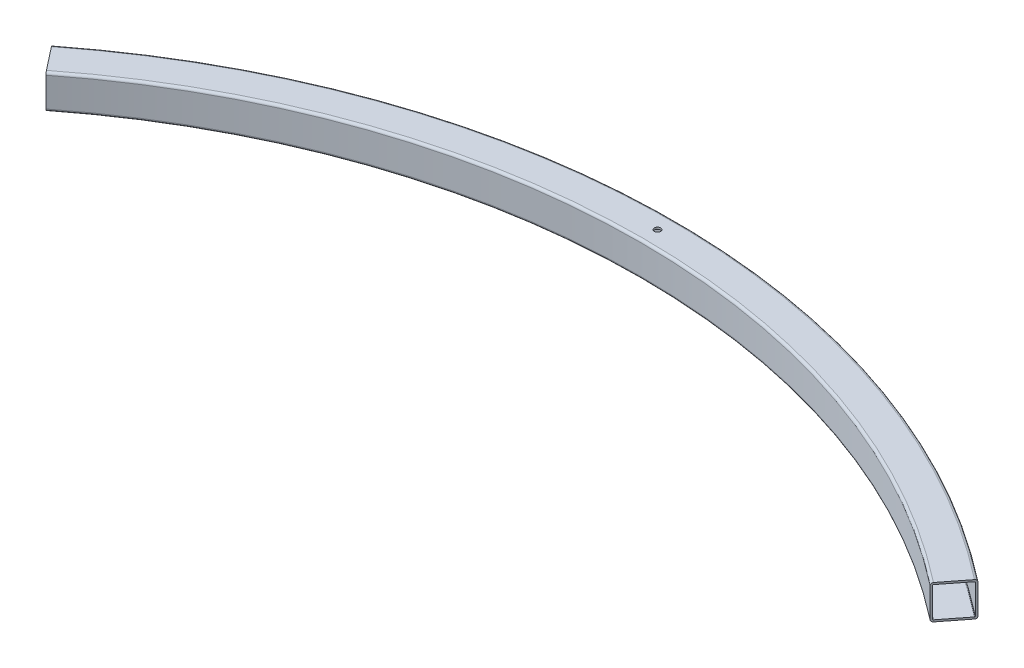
ISO-10303-21;
HEADER;
FILE_DESCRIPTION(('STEP AP214'),'2;1');
FILE_NAME('part.step','',(''),(''),'','','');
FILE_SCHEMA(('AUTOMOTIVE_DESIGN { 1 0 10303 214 1 1 1 1 }'));
ENDSEC;
DATA;
#1=APPLICATION_CONTEXT('core data for automotive mechanical design processes');
#2=APPLICATION_PROTOCOL_DEFINITION('international standard','automotive_design',2000,#1);
#3=PRODUCT_CONTEXT('',#1,'mechanical');
#4=PRODUCT('Part','Part','',(#3));
#5=PRODUCT_RELATED_PRODUCT_CATEGORY('part','',(#4));
#6=PRODUCT_DEFINITION_FORMATION('','',#4);
#7=PRODUCT_DEFINITION_CONTEXT('part definition',#1,'design');
#8=PRODUCT_DEFINITION('design','',#6,#7);
#9=PRODUCT_DEFINITION_SHAPE('','',#8);
#10=(LENGTH_UNIT() NAMED_UNIT(*) SI_UNIT(.MILLI.,.METRE.));
#11=(NAMED_UNIT(*) PLANE_ANGLE_UNIT() SI_UNIT($,.RADIAN.));
#12=(NAMED_UNIT(*) SI_UNIT($,.STERADIAN.) SOLID_ANGLE_UNIT());
#13=UNCERTAINTY_MEASURE_WITH_UNIT(LENGTH_MEASURE(1.E-05),#10,'distance_accuracy_value','');
#14=(GEOMETRIC_REPRESENTATION_CONTEXT(3) GLOBAL_UNCERTAINTY_ASSIGNED_CONTEXT((#13)) GLOBAL_UNIT_ASSIGNED_CONTEXT((#10,
#11,#12)) REPRESENTATION_CONTEXT('',''));
#15=CARTESIAN_POINT('',(0.,0.,0.));
#16=DIRECTION('',(0.,0.,1.));
#17=DIRECTION('',(1.,0.,0.));
#18=AXIS2_PLACEMENT_3D('',#15,#16,#17);
#19=CARTESIAN_POINT('',(0.,64.77,1465.075));
#20=DIRECTION('',(0.,1.,0.));
#21=DIRECTION('',(0.,0.,1.));
#22=AXIS2_PLACEMENT_3D('',#19,#20,#21);
#23=TOROIDAL_SURFACE('',#22,1470.155,1.27);
#24=CARTESIAN_POINT('',(0.,64.77,1465.075));
#25=DIRECTION('',(0.,1.,0.));
#26=DIRECTION('',(0.,0.,1.));
#27=AXIS2_PLACEMENT_3D('',#24,#25,#26);
#28=CIRCLE('',#27,1468.885);
#29=CARTESIAN_POINT('',(905.396232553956,64.77,308.407024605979));
#30=VERTEX_POINT('',#29);
#31=CARTESIAN_POINT('',(-905.396232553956,64.77,308.407024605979));
#32=VERTEX_POINT('',#31);
#33=EDGE_CURVE('E12',#30,#32,#28,.T.);
#34=ORIENTED_EDGE('',*,*,#33,.T.);
#35=CARTESIAN_POINT('',(-906.179039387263,64.77,307.406967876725));
#36=DIRECTION('',(0.787446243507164,0.,-0.616383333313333));
#37=DIRECTION('',(0.616383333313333,0.,0.787446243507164));
#38=AXIS2_PLACEMENT_3D('',#35,#36,#37);
#39=CIRCLE('',#38,1.27);
#40=CARTESIAN_POINT('',(-906.179039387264,66.04,307.406967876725));
#41=VERTEX_POINT('',#40);
#42=EDGE_CURVE('E195',#41,#32,#39,.T.);
#43=ORIENTED_EDGE('',*,*,#42,.F.);
#44=CARTESIAN_POINT('',(0.,66.04,1465.075));
#45=DIRECTION('',(0.,1.,0.));
#46=DIRECTION('',(0.,0.,1.));
#47=AXIS2_PLACEMENT_3D('',#44,#45,#46);
#48=CIRCLE('',#47,1470.155);
#49=CARTESIAN_POINT('',(906.179039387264,66.04,307.406967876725));
#50=VERTEX_POINT('',#49);
#51=EDGE_CURVE('E273',#50,#41,#48,.T.);
#52=ORIENTED_EDGE('',*,*,#51,.F.);
#53=CARTESIAN_POINT('',(906.179039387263,64.77,307.406967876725));
#54=DIRECTION('',(0.787446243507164,0.,0.616383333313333));
#55=DIRECTION('',(-0.616383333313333,0.,0.787446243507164));
#56=AXIS2_PLACEMENT_3D('',#53,#54,#55);
#57=CIRCLE('',#56,1.27);
#58=EDGE_CURVE('E240',#50,#30,#57,.T.);
#59=ORIENTED_EDGE('',*,*,#58,.T.);
#60=EDGE_LOOP('',(#34,#43,#52,#59));
#61=FACE_BOUND('',#60,.T.);
#62=ADVANCED_FACE('F34',(#61),#23,.F.);
#63=CARTESIAN_POINT('',(0.,0.,1465.075));
#64=DIRECTION('',(0.,1.,0.));
#65=DIRECTION('',(0.,0.,1.));
#66=AXIS2_PLACEMENT_3D('',#63,#64,#65);
#67=CYLINDRICAL_SURFACE('',#66,1468.885);
#68=CARTESIAN_POINT('',(0.,5.08,1465.075));
#69=DIRECTION('',(0.,1.,0.));
#70=DIRECTION('',(0.,0.,1.));
#71=AXIS2_PLACEMENT_3D('',#68,#69,#70);
#72=CIRCLE('',#71,1468.885);
#73=CARTESIAN_POINT('',(905.396232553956,5.08,308.407024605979));
#74=VERTEX_POINT('',#73);
#75=CARTESIAN_POINT('',(-905.396232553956,5.08,308.407024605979));
#76=VERTEX_POINT('',#75);
#77=EDGE_CURVE('E43',#74,#76,#72,.T.);
#78=ORIENTED_EDGE('',*,*,#77,.T.);
#79=DIRECTION('',(0.,-1.,0.));
#80=VECTOR('',#79,1.);
#81=CARTESIAN_POINT('',(-905.396232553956,5.08000000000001,308.407024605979));
#82=LINE('',#81,#80);
#83=EDGE_CURVE('E216',#32,#76,#82,.T.);
#84=ORIENTED_EDGE('',*,*,#83,.F.);
#85=ORIENTED_EDGE('',*,*,#33,.F.);
#86=DIRECTION('',(0.,-1.,0.));
#87=VECTOR('',#86,1.);
#88=CARTESIAN_POINT('',(905.396232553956,5.08000000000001,308.407024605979));
#89=LINE('',#88,#87);
#90=EDGE_CURVE('E159',#30,#74,#89,.T.);
#91=ORIENTED_EDGE('',*,*,#90,.T.);
#92=EDGE_LOOP('',(#78,#84,#85,#91));
#93=FACE_BOUND('',#92,.T.);
#94=ADVANCED_FACE('F36',(#93),#67,.T.);
#95=CARTESIAN_POINT('',(0.,5.08,1465.075));
#96=DIRECTION('',(0.,1.,0.));
#97=DIRECTION('',(0.,0.,1.));
#98=AXIS2_PLACEMENT_3D('',#95,#96,#97);
#99=TOROIDAL_SURFACE('',#98,1470.155,1.27);
#100=CARTESIAN_POINT('',(0.,3.81,1465.075));
#101=DIRECTION('',(0.,1.,0.));
#102=DIRECTION('',(0.,0.,1.));
#103=AXIS2_PLACEMENT_3D('',#100,#101,#102);
#104=CIRCLE('',#103,1470.155);
#105=CARTESIAN_POINT('',(906.179039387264,3.81,307.406967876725));
#106=VERTEX_POINT('',#105);
#107=CARTESIAN_POINT('',(-906.179039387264,3.81,307.406967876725));
#108=VERTEX_POINT('',#107);
#109=EDGE_CURVE('E283',#106,#108,#104,.T.);
#110=ORIENTED_EDGE('',*,*,#109,.T.);
#111=CARTESIAN_POINT('',(-906.179039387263,5.08,307.406967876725));
#112=DIRECTION('',(0.787446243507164,0.,-0.616383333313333));
#113=DIRECTION('',(0.616383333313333,0.,0.787446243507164));
#114=AXIS2_PLACEMENT_3D('',#111,#112,#113);
#115=CIRCLE('',#114,1.27);
#116=EDGE_CURVE('E213',#76,#108,#115,.T.);
#117=ORIENTED_EDGE('',*,*,#116,.F.);
#118=ORIENTED_EDGE('',*,*,#77,.F.);
#119=CARTESIAN_POINT('',(906.179039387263,5.08,307.406967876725));
#120=DIRECTION('',(0.787446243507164,0.,0.616383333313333));
#121=DIRECTION('',(-0.616383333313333,0.,0.787446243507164));
#122=AXIS2_PLACEMENT_3D('',#119,#120,#121);
#123=CIRCLE('',#122,1.27);
#124=EDGE_CURVE('E258',#74,#106,#123,.T.);
#125=ORIENTED_EDGE('',*,*,#124,.T.);
#126=EDGE_LOOP('',(#110,#117,#118,#125));
#127=FACE_BOUND('',#126,.T.);
#128=ADVANCED_FACE('F285',(#127),#99,.F.);
#129=CARTESIAN_POINT('',(906.179039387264,3.81,307.406967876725));
#130=DIRECTION('',(0.,1.,0.));
#131=DIRECTION('',(0.,0.,1.));
#132=AXIS2_PLACEMENT_3D('',#129,#130,#131);
#133=PLANE('',#132);
#134=CARTESIAN_POINT('',(0.,3.81,-34.9250000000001));
#135=DIRECTION('',(0.,1.,0.));
#136=DIRECTION('',(0.,0.,1.));
#137=AXIS2_PLACEMENT_3D('',#134,#135,#136);
#138=CIRCLE('',#137,6.35);
#139=CARTESIAN_POINT('',(0.,3.81,-28.5750000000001));
#140=VERTEX_POINT('',#139);
#141=EDGE_CURVE('E174',#140,#140,#138,.T.);
#142=ORIENTED_EDGE('',*,*,#141,.F.);
#143=EDGE_LOOP('',(#142));
#144=FACE_BOUND('',#143,.T.);
#145=CARTESIAN_POINT('',(0.,3.81,1465.075));
#146=DIRECTION('',(0.,1.,0.));
#147=DIRECTION('',(0.,0.,1.));
#148=AXIS2_PLACEMENT_3D('',#145,#146,#147);
#149=CIRCLE('',#148,1529.845);
#150=CARTESIAN_POINT('',(942.970960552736,3.81,260.404301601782));
#151=VERTEX_POINT('',#150);
#152=CARTESIAN_POINT('',(-942.970960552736,3.81,260.404301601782));
#153=VERTEX_POINT('',#152);
#154=EDGE_CURVE('E281',#151,#153,#149,.T.);
#155=ORIENTED_EDGE('',*,*,#154,.T.);
#156=DIRECTION('',(-0.616383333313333,0.,-0.787446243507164));
#157=VECTOR('',#156,1.);
#158=CARTESIAN_POINT('',(-906.179039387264,3.81,307.406967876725));
#159=LINE('',#158,#157);
#160=EDGE_CURVE('E210',#108,#153,#159,.T.);
#161=ORIENTED_EDGE('',*,*,#160,.F.);
#162=ORIENTED_EDGE('',*,*,#109,.F.);
#163=DIRECTION('',(0.616383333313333,0.,-0.787446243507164));
#164=VECTOR('',#163,1.);
#165=CARTESIAN_POINT('',(906.179039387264,3.81,307.406967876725));
#166=LINE('',#165,#164);
#167=EDGE_CURVE('E255',#106,#151,#166,.T.);
#168=ORIENTED_EDGE('',*,*,#167,.T.);
#169=EDGE_LOOP('',(#155,#161,#162,#168));
#170=FACE_BOUND('',#169,.T.);
#171=ADVANCED_FACE('F299',(#144,#170),#133,.T.);
#172=CARTESIAN_POINT('',(0.,5.08,1465.075));
#173=DIRECTION('',(0.,1.,0.));
#174=DIRECTION('',(0.,0.,1.));
#175=AXIS2_PLACEMENT_3D('',#172,#173,#174);
#176=TOROIDAL_SURFACE('',#175,1529.845,1.27);
#177=CARTESIAN_POINT('',(0.,5.08000000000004,1465.075));
#178=DIRECTION('',(0.,1.,0.));
#179=DIRECTION('',(0.,0.,1.));
#180=AXIS2_PLACEMENT_3D('',#177,#178,#179);
#181=CIRCLE('',#180,1531.115);
#182=CARTESIAN_POINT('',(943.753767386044,5.08000000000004,259.404244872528));
#183=VERTEX_POINT('',#182);
#184=CARTESIAN_POINT('',(-943.753767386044,5.08000000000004,259.404244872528));
#185=VERTEX_POINT('',#184);
#186=EDGE_CURVE('E279',#183,#185,#181,.T.);
#187=ORIENTED_EDGE('',*,*,#186,.T.);
#188=CARTESIAN_POINT('',(-942.970960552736,5.08,260.404301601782));
#189=DIRECTION('',(0.787446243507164,0.,-0.616383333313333));
#190=DIRECTION('',(-0.616383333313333,0.,-0.787446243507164));
#191=AXIS2_PLACEMENT_3D('',#188,#189,#190);
#192=CIRCLE('',#191,1.27);
#193=EDGE_CURVE('E207',#153,#185,#192,.T.);
#194=ORIENTED_EDGE('',*,*,#193,.F.);
#195=ORIENTED_EDGE('',*,*,#154,.F.);
#196=CARTESIAN_POINT('',(942.970960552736,5.08,260.404301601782));
#197=DIRECTION('',(0.787446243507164,0.,0.616383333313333));
#198=DIRECTION('',(0.616383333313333,0.,-0.787446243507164));
#199=AXIS2_PLACEMENT_3D('',#196,#197,#198);
#200=CIRCLE('',#199,1.27);
#201=EDGE_CURVE('E252',#151,#183,#200,.T.);
#202=ORIENTED_EDGE('',*,*,#201,.T.);
#203=EDGE_LOOP('',(#187,#194,#195,#202));
#204=FACE_BOUND('',#203,.T.);
#205=ADVANCED_FACE('F303',(#204),#176,.F.);
#206=CARTESIAN_POINT('',(0.,0.,1465.075));
#207=DIRECTION('',(0.,1.,0.));
#208=DIRECTION('',(0.,0.,1.));
#209=AXIS2_PLACEMENT_3D('',#206,#207,#208);
#210=CYLINDRICAL_SURFACE('',#209,1531.115);
#211=CARTESIAN_POINT('',(0.,64.77,1465.075));
#212=DIRECTION('',(0.,1.,0.));
#213=DIRECTION('',(0.,0.,1.));
#214=AXIS2_PLACEMENT_3D('',#211,#212,#213);
#215=CIRCLE('',#214,1531.115);
#216=CARTESIAN_POINT('',(943.753767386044,64.77,259.404244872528));
#217=VERTEX_POINT('',#216);
#218=CARTESIAN_POINT('',(-943.753767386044,64.77,259.404244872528));
#219=VERTEX_POINT('',#218);
#220=EDGE_CURVE('E277',#217,#219,#215,.T.);
#221=ORIENTED_EDGE('',*,*,#220,.T.);
#222=DIRECTION('',(0.,1.,0.));
#223=VECTOR('',#222,1.);
#224=CARTESIAN_POINT('',(-943.753767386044,5.08000000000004,259.404244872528));
#225=LINE('',#224,#223);
#226=EDGE_CURVE('E204',#185,#219,#225,.T.);
#227=ORIENTED_EDGE('',*,*,#226,.F.);
#228=ORIENTED_EDGE('',*,*,#186,.F.);
#229=DIRECTION('',(0.,1.,0.));
#230=VECTOR('',#229,1.);
#231=CARTESIAN_POINT('',(943.753767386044,5.08000000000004,259.404244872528));
#232=LINE('',#231,#230);
#233=EDGE_CURVE('E249',#183,#217,#232,.T.);
#234=ORIENTED_EDGE('',*,*,#233,.T.);
#235=EDGE_LOOP('',(#221,#227,#228,#234));
#236=FACE_BOUND('',#235,.T.);
#237=ADVANCED_FACE('F305',(#236),#210,.F.);
#238=CARTESIAN_POINT('',(0.,64.77,1465.075));
#239=DIRECTION('',(0.,1.,0.));
#240=DIRECTION('',(0.,0.,1.));
#241=AXIS2_PLACEMENT_3D('',#238,#239,#240);
#242=TOROIDAL_SURFACE('',#241,1529.845,1.27000000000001);
#243=CARTESIAN_POINT('',(0.,66.04,1465.075));
#244=DIRECTION('',(0.,1.,0.));
#245=DIRECTION('',(0.,0.,1.));
#246=AXIS2_PLACEMENT_3D('',#243,#244,#245);
#247=CIRCLE('',#246,1529.845);
#248=CARTESIAN_POINT('',(942.970960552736,66.04,260.404301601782));
#249=VERTEX_POINT('',#248);
#250=CARTESIAN_POINT('',(-942.970960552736,66.04,260.404301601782));
#251=VERTEX_POINT('',#250);
#252=EDGE_CURVE('E275',#249,#251,#247,.T.);
#253=ORIENTED_EDGE('',*,*,#252,.T.);
#254=CARTESIAN_POINT('',(-942.970960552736,64.77,260.404301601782));
#255=DIRECTION('',(0.787446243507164,0.,-0.616383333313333));
#256=DIRECTION('',(0.616383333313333,0.,0.787446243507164));
#257=AXIS2_PLACEMENT_3D('',#254,#255,#256);
#258=CIRCLE('',#257,1.27000000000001);
#259=EDGE_CURVE('E201',#219,#251,#258,.T.);
#260=ORIENTED_EDGE('',*,*,#259,.F.);
#261=ORIENTED_EDGE('',*,*,#220,.F.);
#262=CARTESIAN_POINT('',(942.970960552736,64.77,260.404301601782));
#263=DIRECTION('',(0.787446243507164,0.,0.616383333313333));
#264=DIRECTION('',(-0.616383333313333,0.,0.787446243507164));
#265=AXIS2_PLACEMENT_3D('',#262,#263,#264);
#266=CIRCLE('',#265,1.27000000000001);
#267=EDGE_CURVE('E246',#217,#249,#266,.T.);
#268=ORIENTED_EDGE('',*,*,#267,.T.);
#269=EDGE_LOOP('',(#253,#260,#261,#268));
#270=FACE_BOUND('',#269,.T.);
#271=ADVANCED_FACE('F308',(#270),#242,.F.);
#272=CARTESIAN_POINT('',(0.,5.08,1465.075));
#273=DIRECTION('',(0.,1.,0.));
#274=DIRECTION('',(0.,0.,1.));
#275=AXIS2_PLACEMENT_3D('',#272,#273,#274);
#276=TOROIDAL_SURFACE('',#275,1470.155,5.08);
#277=CARTESIAN_POINT('',(0.,5.08000000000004,1465.075));
#278=DIRECTION('',(0.,1.,0.));
#279=DIRECTION('',(0.,0.,1.));
#280=AXIS2_PLACEMENT_3D('',#277,#278,#279);
#281=CIRCLE('',#280,1465.075);
#282=CARTESIAN_POINT('',(903.047812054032,5.08000000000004,311.407194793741));
#283=VERTEX_POINT('',#282);
#284=CARTESIAN_POINT('',(-903.047812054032,5.08000000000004,311.407194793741));
#285=VERTEX_POINT('',#284);
#286=EDGE_CURVE('E172',#283,#285,#281,.T.);
#287=ORIENTED_EDGE('',*,*,#286,.T.);
#288=CARTESIAN_POINT('',(-906.179039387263,5.08,307.406967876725));
#289=DIRECTION('',(0.787446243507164,0.,-0.616383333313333));
#290=DIRECTION('',(0.616383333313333,0.,0.787446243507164));
#291=AXIS2_PLACEMENT_3D('',#288,#289,#290);
#292=CIRCLE('',#291,5.08);
#293=CARTESIAN_POINT('',(-906.179039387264,0.,307.406967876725));
#294=VERTEX_POINT('',#293);
#295=EDGE_CURVE('E166',#285,#294,#292,.T.);
#296=ORIENTED_EDGE('',*,*,#295,.T.);
#297=CARTESIAN_POINT('',(0.,0.,1465.075));
#298=DIRECTION('',(0.,1.,0.));
#299=DIRECTION('',(0.,0.,1.));
#300=AXIS2_PLACEMENT_3D('',#297,#298,#299);
#301=CIRCLE('',#300,1470.155);
#302=CARTESIAN_POINT('',(906.179039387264,0.,307.406967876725));
#303=VERTEX_POINT('',#302);
#304=EDGE_CURVE('E147',#303,#294,#301,.T.);
#305=ORIENTED_EDGE('',*,*,#304,.F.);
#306=CARTESIAN_POINT('',(906.179039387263,5.08,307.406967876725));
#307=DIRECTION('',(0.787446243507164,0.,0.616383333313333));
#308=DIRECTION('',(-0.616383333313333,0.,0.787446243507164));
#309=AXIS2_PLACEMENT_3D('',#306,#307,#308);
#310=CIRCLE('',#309,5.08);
#311=EDGE_CURVE('E219',#283,#303,#310,.T.);
#312=ORIENTED_EDGE('',*,*,#311,.F.);
#313=EDGE_LOOP('',(#287,#296,#305,#312));
#314=FACE_BOUND('',#313,.T.);
#315=ADVANCED_FACE('F171',(#314),#276,.T.);
#316=CARTESIAN_POINT('',(0.,0.,1465.075));
#317=DIRECTION('',(0.,1.,0.));
#318=DIRECTION('',(0.,0.,1.));
#319=AXIS2_PLACEMENT_3D('',#316,#317,#318);
#320=CYLINDRICAL_SURFACE('',#319,1465.075);
#321=CARTESIAN_POINT('',(0.,64.77,1465.075));
#322=DIRECTION('',(0.,1.,0.));
#323=DIRECTION('',(0.,0.,1.));
#324=AXIS2_PLACEMENT_3D('',#321,#322,#323);
#325=CIRCLE('',#324,1465.075);
#326=CARTESIAN_POINT('',(903.047812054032,64.77,311.407194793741));
#327=VERTEX_POINT('',#326);
#328=CARTESIAN_POINT('',(-903.047812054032,64.77,311.407194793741));
#329=VERTEX_POINT('',#328);
#330=EDGE_CURVE('E270',#327,#329,#325,.T.);
#331=ORIENTED_EDGE('',*,*,#330,.T.);
#332=DIRECTION('',(0.,-1.,0.));
#333=VECTOR('',#332,1.);
#334=CARTESIAN_POINT('',(-903.047812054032,5.08000000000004,311.407194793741));
#335=LINE('',#334,#333);
#336=EDGE_CURVE('E193',#329,#285,#335,.T.);
#337=ORIENTED_EDGE('',*,*,#336,.T.);
#338=ORIENTED_EDGE('',*,*,#286,.F.);
#339=DIRECTION('',(0.,-1.,0.));
#340=VECTOR('',#339,1.);
#341=CARTESIAN_POINT('',(903.047812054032,5.08000000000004,311.407194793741));
#342=LINE('',#341,#340);
#343=EDGE_CURVE('E237',#327,#283,#342,.T.);
#344=ORIENTED_EDGE('',*,*,#343,.F.);
#345=EDGE_LOOP('',(#331,#337,#338,#344));
#346=FACE_BOUND('',#345,.T.);
#347=ADVANCED_FACE('F331',(#346),#320,.F.);
#348=CARTESIAN_POINT('',(0.,64.77,1465.075));
#349=DIRECTION('',(0.,1.,0.));
#350=DIRECTION('',(0.,0.,1.));
#351=AXIS2_PLACEMENT_3D('',#348,#349,#350);
#352=TOROIDAL_SURFACE('',#351,1470.155,5.08);
#353=CARTESIAN_POINT('',(0.,69.85,1465.075));
#354=DIRECTION('',(0.,1.,0.));
#355=DIRECTION('',(0.,0.,1.));
#356=AXIS2_PLACEMENT_3D('',#353,#354,#355);
#357=CIRCLE('',#356,1470.155);
#358=CARTESIAN_POINT('',(906.179039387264,69.85,307.406967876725));
#359=VERTEX_POINT('',#358);
#360=CARTESIAN_POINT('',(-906.179039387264,69.85,307.406967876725));
#361=VERTEX_POINT('',#360);
#362=EDGE_CURVE('E268',#359,#361,#357,.T.);
#363=ORIENTED_EDGE('',*,*,#362,.T.);
#364=CARTESIAN_POINT('',(-906.179039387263,64.77,307.406967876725));
#365=DIRECTION('',(0.787446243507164,0.,-0.616383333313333));
#366=DIRECTION('',(0.616383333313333,0.,0.787446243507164));
#367=AXIS2_PLACEMENT_3D('',#364,#365,#366);
#368=CIRCLE('',#367,5.08);
#369=EDGE_CURVE('E190',#361,#329,#368,.T.);
#370=ORIENTED_EDGE('',*,*,#369,.T.);
#371=ORIENTED_EDGE('',*,*,#330,.F.);
#372=CARTESIAN_POINT('',(906.179039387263,64.77,307.406967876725));
#373=DIRECTION('',(0.787446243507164,0.,0.616383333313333));
#374=DIRECTION('',(-0.616383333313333,0.,0.787446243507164));
#375=AXIS2_PLACEMENT_3D('',#372,#373,#374);
#376=CIRCLE('',#375,5.08);
#377=EDGE_CURVE('E234',#359,#327,#376,.T.);
#378=ORIENTED_EDGE('',*,*,#377,.F.);
#379=EDGE_LOOP('',(#363,#370,#371,#378));
#380=FACE_BOUND('',#379,.T.);
#381=ADVANCED_FACE('F334',(#380),#352,.T.);
#382=CARTESIAN_POINT('',(906.179039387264,69.85,307.406967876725));
#383=DIRECTION('',(0.,-1.,0.));
#384=DIRECTION('',(0.,0.,-1.));
#385=AXIS2_PLACEMENT_3D('',#382,#383,#384);
#386=PLANE('',#385);
#387=CARTESIAN_POINT('',(0.,69.85,-34.9250000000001));
#388=DIRECTION('',(0.,1.,0.));
#389=DIRECTION('',(0.,0.,1.));
#390=AXIS2_PLACEMENT_3D('',#387,#388,#389);
#391=CIRCLE('',#390,6.35);
#392=CARTESIAN_POINT('',(0.,69.85,-28.5750000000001));
#393=VERTEX_POINT('',#392);
#394=EDGE_CURVE('E370',#393,#393,#391,.T.);
#395=ORIENTED_EDGE('',*,*,#394,.F.);
#396=EDGE_LOOP('',(#395));
#397=FACE_BOUND('',#396,.T.);
#398=CARTESIAN_POINT('',(0.,69.85,1465.075));
#399=DIRECTION('',(0.,1.,0.));
#400=DIRECTION('',(0.,0.,1.));
#401=AXIS2_PLACEMENT_3D('',#398,#399,#400);
#402=CIRCLE('',#401,1529.845);
#403=CARTESIAN_POINT('',(942.970960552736,69.85,260.404301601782));
#404=VERTEX_POINT('',#403);
#405=CARTESIAN_POINT('',(-942.970960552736,69.85,260.404301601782));
#406=VERTEX_POINT('',#405);
#407=EDGE_CURVE('E266',#404,#406,#402,.T.);
#408=ORIENTED_EDGE('',*,*,#407,.T.);
#409=DIRECTION('',(0.616383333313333,0.,0.787446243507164));
#410=VECTOR('',#409,1.);
#411=CARTESIAN_POINT('',(-906.179039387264,69.85,307.406967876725));
#412=LINE('',#411,#410);
#413=EDGE_CURVE('E187',#406,#361,#412,.T.);
#414=ORIENTED_EDGE('',*,*,#413,.T.);
#415=ORIENTED_EDGE('',*,*,#362,.F.);
#416=DIRECTION('',(-0.616383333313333,0.,0.787446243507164));
#417=VECTOR('',#416,1.);
#418=CARTESIAN_POINT('',(906.179039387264,69.85,307.406967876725));
#419=LINE('',#418,#417);
#420=EDGE_CURVE('E231',#404,#359,#419,.T.);
#421=ORIENTED_EDGE('',*,*,#420,.F.);
#422=EDGE_LOOP('',(#408,#414,#415,#421));
#423=FACE_BOUND('',#422,.T.);
#424=ADVANCED_FACE('F338',(#397,#423),#386,.F.);
#425=CARTESIAN_POINT('',(0.,64.77,1465.075));
#426=DIRECTION('',(0.,1.,0.));
#427=DIRECTION('',(0.,0.,1.));
#428=AXIS2_PLACEMENT_3D('',#425,#426,#427);
#429=TOROIDAL_SURFACE('',#428,1529.845,5.08);
#430=CARTESIAN_POINT('',(0.,64.77,1465.075));
#431=DIRECTION('',(0.,1.,0.));
#432=DIRECTION('',(0.,0.,1.));
#433=AXIS2_PLACEMENT_3D('',#430,#431,#432);
#434=CIRCLE('',#433,1534.925);
#435=CARTESIAN_POINT('',(946.102187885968,64.77,256.404074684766));
#436=VERTEX_POINT('',#435);
#437=CARTESIAN_POINT('',(-946.102187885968,64.77,256.404074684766));
#438=VERTEX_POINT('',#437);
#439=EDGE_CURVE('E264',#436,#438,#434,.T.);
#440=ORIENTED_EDGE('',*,*,#439,.T.);
#441=CARTESIAN_POINT('',(-942.970960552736,64.77,260.404301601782));
#442=DIRECTION('',(0.787446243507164,0.,-0.616383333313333));
#443=DIRECTION('',(0.616383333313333,0.,0.787446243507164));
#444=AXIS2_PLACEMENT_3D('',#441,#442,#443);
#445=CIRCLE('',#444,5.08);
#446=EDGE_CURVE('E184',#438,#406,#445,.T.);
#447=ORIENTED_EDGE('',*,*,#446,.T.);
#448=ORIENTED_EDGE('',*,*,#407,.F.);
#449=CARTESIAN_POINT('',(942.970960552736,64.77,260.404301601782));
#450=DIRECTION('',(0.787446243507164,0.,0.616383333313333));
#451=DIRECTION('',(-0.616383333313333,0.,0.787446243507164));
#452=AXIS2_PLACEMENT_3D('',#449,#450,#451);
#453=CIRCLE('',#452,5.08);
#454=EDGE_CURVE('E228',#436,#404,#453,.T.);
#455=ORIENTED_EDGE('',*,*,#454,.F.);
#456=EDGE_LOOP('',(#440,#447,#448,#455));
#457=FACE_BOUND('',#456,.T.);
#458=ADVANCED_FACE('F342',(#457),#429,.T.);
#459=CARTESIAN_POINT('',(0.,0.,1465.075));
#460=DIRECTION('',(0.,1.,0.));
#461=DIRECTION('',(0.,0.,1.));
#462=AXIS2_PLACEMENT_3D('',#459,#460,#461);
#463=CYLINDRICAL_SURFACE('',#462,1534.925);
#464=CARTESIAN_POINT('',(0.,5.08,1465.075));
#465=DIRECTION('',(0.,1.,0.));
#466=DIRECTION('',(0.,0.,1.));
#467=AXIS2_PLACEMENT_3D('',#464,#465,#466);
#468=CIRCLE('',#467,1534.925);
#469=CARTESIAN_POINT('',(946.102187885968,5.08,256.404074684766));
#470=VERTEX_POINT('',#469);
#471=CARTESIAN_POINT('',(-946.102187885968,5.08,256.404074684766));
#472=VERTEX_POINT('',#471);
#473=EDGE_CURVE('E262',#470,#472,#468,.T.);
#474=ORIENTED_EDGE('',*,*,#473,.T.);
#475=DIRECTION('',(0.,1.,0.));
#476=VECTOR('',#475,1.);
#477=CARTESIAN_POINT('',(-946.102187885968,5.08000000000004,256.404074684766));
#478=LINE('',#477,#476);
#479=EDGE_CURVE('E181',#472,#438,#478,.T.);
#480=ORIENTED_EDGE('',*,*,#479,.T.);
#481=ORIENTED_EDGE('',*,*,#439,.F.);
#482=DIRECTION('',(0.,1.,0.));
#483=VECTOR('',#482,1.);
#484=CARTESIAN_POINT('',(946.102187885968,5.08000000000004,256.404074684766));
#485=LINE('',#484,#483);
#486=EDGE_CURVE('E225',#470,#436,#485,.T.);
#487=ORIENTED_EDGE('',*,*,#486,.F.);
#488=EDGE_LOOP('',(#474,#480,#481,#487));
#489=FACE_BOUND('',#488,.T.);
#490=ADVANCED_FACE('F346',(#489),#463,.T.);
#491=CARTESIAN_POINT('',(0.,5.08,1465.075));
#492=DIRECTION('',(0.,1.,0.));
#493=DIRECTION('',(0.,0.,1.));
#494=AXIS2_PLACEMENT_3D('',#491,#492,#493);
#495=TOROIDAL_SURFACE('',#494,1529.845,5.08);
#496=CARTESIAN_POINT('',(0.,0.,1465.075));
#497=DIRECTION('',(0.,1.,0.));
#498=DIRECTION('',(0.,0.,1.));
#499=AXIS2_PLACEMENT_3D('',#496,#497,#498);
#500=CIRCLE('',#499,1529.845);
#501=CARTESIAN_POINT('',(942.970960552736,0.,260.404301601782));
#502=VERTEX_POINT('',#501);
#503=CARTESIAN_POINT('',(-942.970960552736,0.,260.404301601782));
#504=VERTEX_POINT('',#503);
#505=EDGE_CURVE('E158',#502,#504,#500,.T.);
#506=ORIENTED_EDGE('',*,*,#505,.T.);
#507=CARTESIAN_POINT('',(-942.970960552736,5.08,260.404301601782));
#508=DIRECTION('',(0.787446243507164,0.,-0.616383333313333));
#509=DIRECTION('',(-0.616383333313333,0.,-0.787446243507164));
#510=AXIS2_PLACEMENT_3D('',#507,#508,#509);
#511=CIRCLE('',#510,5.08);
#512=EDGE_CURVE('E169',#504,#472,#511,.T.);
#513=ORIENTED_EDGE('',*,*,#512,.T.);
#514=ORIENTED_EDGE('',*,*,#473,.F.);
#515=CARTESIAN_POINT('',(942.970960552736,5.08,260.404301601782));
#516=DIRECTION('',(0.787446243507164,0.,0.616383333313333));
#517=DIRECTION('',(0.616383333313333,0.,-0.787446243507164));
#518=AXIS2_PLACEMENT_3D('',#515,#516,#517);
#519=CIRCLE('',#518,5.08);
#520=EDGE_CURVE('E222',#502,#470,#519,.T.);
#521=ORIENTED_EDGE('',*,*,#520,.F.);
#522=EDGE_LOOP('',(#506,#513,#514,#521));
#523=FACE_BOUND('',#522,.T.);
#524=ADVANCED_FACE('F320',(#523),#495,.T.);
#525=CARTESIAN_POINT('',(906.179039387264,0.,307.406967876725));
#526=DIRECTION('',(0.,1.,0.));
#527=DIRECTION('',(0.,0.,1.));
#528=AXIS2_PLACEMENT_3D('',#525,#526,#527);
#529=PLANE('',#528);
#530=CARTESIAN_POINT('',(0.,0.,-34.9250000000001));
#531=DIRECTION('',(0.,1.,0.));
#532=DIRECTION('',(0.,0.,1.));
#533=AXIS2_PLACEMENT_3D('',#530,#531,#532);
#534=CIRCLE('',#533,6.35);
#535=CARTESIAN_POINT('',(0.,0.,-28.5750000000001));
#536=VERTEX_POINT('',#535);
#537=EDGE_CURVE('E371',#536,#536,#534,.T.);
#538=ORIENTED_EDGE('',*,*,#537,.T.);
#539=EDGE_LOOP('',(#538));
#540=FACE_BOUND('',#539,.T.);
#541=DIRECTION('',(0.616383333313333,0.,-0.787446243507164));
#542=VECTOR('',#541,1.);
#543=CARTESIAN_POINT('',(906.179039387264,0.,307.406967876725));
#544=LINE('',#543,#542);
#545=EDGE_CURVE('E153',#303,#502,#544,.T.);
#546=ORIENTED_EDGE('',*,*,#545,.F.);
#547=ORIENTED_EDGE('',*,*,#304,.T.);
#548=DIRECTION('',(-0.616383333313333,0.,-0.787446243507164));
#549=VECTOR('',#548,1.);
#550=CARTESIAN_POINT('',(-906.179039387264,0.,307.406967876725));
#551=LINE('',#550,#549);
#552=EDGE_CURVE('E150',#294,#504,#551,.T.);
#553=ORIENTED_EDGE('',*,*,#552,.T.);
#554=ORIENTED_EDGE('',*,*,#505,.F.);
#555=EDGE_LOOP('',(#546,#547,#553,#554));
#556=FACE_BOUND('',#555,.T.);
#557=ADVANCED_FACE('F149',(#540,#556),#529,.F.);
#558=CARTESIAN_POINT('',(906.179039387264,66.04,307.406967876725));
#559=DIRECTION('',(0.,-1.,0.));
#560=DIRECTION('',(0.,0.,-1.));
#561=AXIS2_PLACEMENT_3D('',#558,#559,#560);
#562=PLANE('',#561);
#563=CARTESIAN_POINT('',(0.,66.04,-34.9250000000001));
#564=DIRECTION('',(0.,-1.,0.));
#565=DIRECTION('',(0.,0.,-1.));
#566=AXIS2_PLACEMENT_3D('',#563,#564,#565);
#567=CIRCLE('',#566,6.35);
#568=CARTESIAN_POINT('',(0.,66.04,-41.2750000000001));
#569=VERTEX_POINT('',#568);
#570=EDGE_CURVE('E38',#569,#569,#567,.T.);
#571=ORIENTED_EDGE('',*,*,#570,.F.);
#572=EDGE_LOOP('',(#571));
#573=FACE_BOUND('',#572,.T.);
#574=DIRECTION('',(-0.616383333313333,0.,0.787446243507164));
#575=VECTOR('',#574,1.);
#576=CARTESIAN_POINT('',(906.179039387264,66.04,307.406967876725));
#577=LINE('',#576,#575);
#578=EDGE_CURVE('E243',#249,#50,#577,.T.);
#579=ORIENTED_EDGE('',*,*,#578,.T.);
#580=ORIENTED_EDGE('',*,*,#51,.T.);
#581=DIRECTION('',(0.616383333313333,0.,0.787446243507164));
#582=VECTOR('',#581,1.);
#583=CARTESIAN_POINT('',(-906.179039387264,66.04,307.406967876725));
#584=LINE('',#583,#582);
#585=EDGE_CURVE('E198',#251,#41,#584,.T.);
#586=ORIENTED_EDGE('',*,*,#585,.F.);
#587=ORIENTED_EDGE('',*,*,#252,.F.);
#588=EDGE_LOOP('',(#579,#580,#586,#587));
#589=FACE_BOUND('',#588,.T.);
#590=ADVANCED_FACE('F310',(#573,#589),#562,.T.);
#591=CARTESIAN_POINT('',(906.179039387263,5.08,307.406967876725));
#592=DIRECTION('',(-0.787446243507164,0.,-0.616383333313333));
#593=DIRECTION('',(-0.616383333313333,0.,0.787446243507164));
#594=AXIS2_PLACEMENT_3D('',#591,#592,#593);
#595=PLANE('',#594);
#596=ORIENTED_EDGE('',*,*,#311,.T.);
#597=ORIENTED_EDGE('',*,*,#545,.T.);
#598=ORIENTED_EDGE('',*,*,#520,.T.);
#599=ORIENTED_EDGE('',*,*,#486,.T.);
#600=ORIENTED_EDGE('',*,*,#454,.T.);
#601=ORIENTED_EDGE('',*,*,#420,.T.);
#602=ORIENTED_EDGE('',*,*,#377,.T.);
#603=ORIENTED_EDGE('',*,*,#343,.T.);
#604=EDGE_LOOP('',(#596,#597,#598,#599,#600,#601,#602,#603));
#605=FACE_BOUND('',#604,.T.);
#606=ORIENTED_EDGE('',*,*,#58,.F.);
#607=ORIENTED_EDGE('',*,*,#578,.F.);
#608=ORIENTED_EDGE('',*,*,#267,.F.);
#609=ORIENTED_EDGE('',*,*,#233,.F.);
#610=ORIENTED_EDGE('',*,*,#201,.F.);
#611=ORIENTED_EDGE('',*,*,#167,.F.);
#612=ORIENTED_EDGE('',*,*,#124,.F.);
#613=ORIENTED_EDGE('',*,*,#90,.F.);
#614=EDGE_LOOP('',(#606,#607,#608,#609,#610,#611,#612,#613));
#615=FACE_BOUND('',#614,.T.);
#616=ADVANCED_FACE('F293',(#605,#615),#595,.F.);
#617=CARTESIAN_POINT('',(-906.179039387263,5.08,307.406967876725));
#618=DIRECTION('',(-0.787446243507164,0.,0.616383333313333));
#619=DIRECTION('',(0.616383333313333,0.,0.787446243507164));
#620=AXIS2_PLACEMENT_3D('',#617,#618,#619);
#621=PLANE('',#620);
#622=ORIENTED_EDGE('',*,*,#295,.F.);
#623=ORIENTED_EDGE('',*,*,#336,.F.);
#624=ORIENTED_EDGE('',*,*,#369,.F.);
#625=ORIENTED_EDGE('',*,*,#413,.F.);
#626=ORIENTED_EDGE('',*,*,#446,.F.);
#627=ORIENTED_EDGE('',*,*,#479,.F.);
#628=ORIENTED_EDGE('',*,*,#512,.F.);
#629=ORIENTED_EDGE('',*,*,#552,.F.);
#630=EDGE_LOOP('',(#622,#623,#624,#625,#626,#627,#628,#629));
#631=FACE_BOUND('',#630,.T.);
#632=ORIENTED_EDGE('',*,*,#42,.T.);
#633=ORIENTED_EDGE('',*,*,#83,.T.);
#634=ORIENTED_EDGE('',*,*,#116,.T.);
#635=ORIENTED_EDGE('',*,*,#160,.T.);
#636=ORIENTED_EDGE('',*,*,#193,.T.);
#637=ORIENTED_EDGE('',*,*,#226,.T.);
#638=ORIENTED_EDGE('',*,*,#259,.T.);
#639=ORIENTED_EDGE('',*,*,#585,.T.);
#640=EDGE_LOOP('',(#632,#633,#634,#635,#636,#637,#638,#639));
#641=FACE_BOUND('',#640,.T.);
#642=ADVANCED_FACE('F163',(#631,#641),#621,.T.);
#643=CARTESIAN_POINT('',(0.,0.,-34.9250000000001));
#644=DIRECTION('',(0.,1.,0.));
#645=DIRECTION('',(0.,0.,1.));
#646=AXIS2_PLACEMENT_3D('',#643,#644,#645);
#647=CYLINDRICAL_SURFACE('',#646,6.35);
#648=ORIENTED_EDGE('',*,*,#570,.T.);
#649=EDGE_LOOP('',(#648));
#650=FACE_BOUND('',#649,.T.);
#651=ORIENTED_EDGE('',*,*,#394,.T.);
#652=EDGE_LOOP('',(#651));
#653=FACE_BOUND('',#652,.T.);
#654=ADVANCED_FACE('F358',(#650,#653),#647,.F.);
#655=ORIENTED_EDGE('',*,*,#141,.T.);
#656=EDGE_LOOP('',(#655));
#657=FACE_BOUND('',#656,.T.);
#658=ORIENTED_EDGE('',*,*,#537,.F.);
#659=EDGE_LOOP('',(#658));
#660=FACE_BOUND('',#659,.T.);
#661=ADVANCED_FACE('F360',(#657,#660),#647,.F.);
#662=CLOSED_SHELL('',(#62,#94,#128,#171,#205,#237,#271,#315,#347,#381,#424,#458,#490,#524,#557,
#590,#616,#642,#654,#661));
#663=MANIFOLD_SOLID_BREP('B2',#662);
#664=ADVANCED_BREP_SHAPE_REPRESENTATION('',(#18,#663),#14);
#665=SHAPE_DEFINITION_REPRESENTATION(#9,#664);
ENDSEC;
END-ISO-10303-21;
